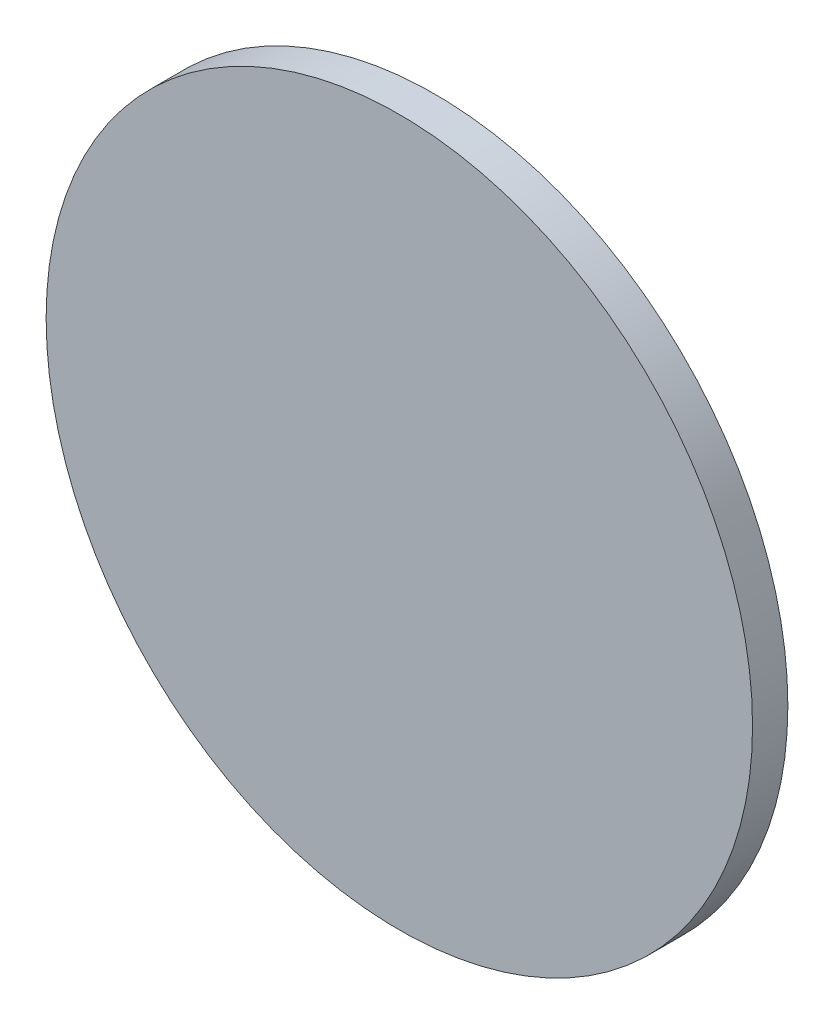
ISO-10303-21;
HEADER;
FILE_DESCRIPTION(('STEP AP214'),'2;1');
FILE_NAME('part.step','',(''),(''),'','','');
FILE_SCHEMA(('AUTOMOTIVE_DESIGN { 1 0 10303 214 1 1 1 1 }'));
ENDSEC;
DATA;
#1=APPLICATION_CONTEXT('core data for automotive mechanical design processes');
#2=APPLICATION_PROTOCOL_DEFINITION('international standard','automotive_design',2000,#1);
#3=PRODUCT_CONTEXT('',#1,'mechanical');
#4=PRODUCT('Part','Part','',(#3));
#5=PRODUCT_RELATED_PRODUCT_CATEGORY('part','',(#4));
#6=PRODUCT_DEFINITION_FORMATION('','',#4);
#7=PRODUCT_DEFINITION_CONTEXT('part definition',#1,'design');
#8=PRODUCT_DEFINITION('design','',#6,#7);
#9=PRODUCT_DEFINITION_SHAPE('','',#8);
#10=(LENGTH_UNIT() NAMED_UNIT(*) SI_UNIT(.MILLI.,.METRE.));
#11=(NAMED_UNIT(*) PLANE_ANGLE_UNIT() SI_UNIT($,.RADIAN.));
#12=(NAMED_UNIT(*) SI_UNIT($,.STERADIAN.) SOLID_ANGLE_UNIT());
#13=UNCERTAINTY_MEASURE_WITH_UNIT(LENGTH_MEASURE(1.E-05),#10,'distance_accuracy_value','');
#14=(GEOMETRIC_REPRESENTATION_CONTEXT(3) GLOBAL_UNCERTAINTY_ASSIGNED_CONTEXT((#13)) GLOBAL_UNIT_ASSIGNED_CONTEXT((#10,
#11,#12)) REPRESENTATION_CONTEXT('',''));
#15=CARTESIAN_POINT('',(0.,0.,0.));
#16=DIRECTION('',(0.,0.,1.));
#17=DIRECTION('',(1.,0.,0.));
#18=AXIS2_PLACEMENT_3D('',#15,#16,#17);
#19=CARTESIAN_POINT('',(0.,0.,14.6421356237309));
#20=DIRECTION('',(0.,0.,-1.));
#21=DIRECTION('',(-1.,0.,0.));
#22=AXIS2_PLACEMENT_3D('',#19,#20,#21);
#23=CYLINDRICAL_SURFACE('',#22,5.);
#24=CARTESIAN_POINT('',(0.,0.,0.));
#25=DIRECTION('',(0.,0.,1.));
#26=DIRECTION('',(1.,0.,0.));
#27=AXIS2_PLACEMENT_3D('',#24,#25,#26);
#28=CIRCLE('',#27,5.);
#29=CARTESIAN_POINT('',(-5.,0.,0.));
#30=VERTEX_POINT('',#29);
#31=EDGE_CURVE('E37',#30,#30,#28,.T.);
#32=CARTESIAN_POINT('',(0.,0.,0.499999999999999));
#33=DIRECTION('',(0.,0.,1.));
#34=DIRECTION('',(1.,0.,0.));
#35=AXIS2_PLACEMENT_3D('',#32,#33,#34);
#36=CIRCLE('',#35,5.);
#37=CARTESIAN_POINT('',(-5.,0.,0.499999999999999));
#38=VERTEX_POINT('',#37);
#39=EDGE_CURVE('E10',#38,#38,#36,.T.);
#40=CARTESIAN_POINT('',(-5.,0.,0.));
#41=CARTESIAN_POINT('',(-5.,0.,0.0052083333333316));
#42=CARTESIAN_POINT('',(-5.,0.,0.0104166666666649));
#43=CARTESIAN_POINT('',(-5.,0.,0.0208333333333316));
#44=CARTESIAN_POINT('',(-5.,0.,0.026041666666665));
#45=CARTESIAN_POINT('',(-5.,0.,0.0364583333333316));
#46=CARTESIAN_POINT('',(-5.,0.,0.041666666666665));
#47=CARTESIAN_POINT('',(-5.,0.,0.0520833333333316));
#48=CARTESIAN_POINT('',(-5.,0.,0.057291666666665));
#49=CARTESIAN_POINT('',(-5.,0.,0.0677083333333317));
#50=CARTESIAN_POINT('',(-5.,0.,0.072916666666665));
#51=CARTESIAN_POINT('',(-5.,0.,0.0833333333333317));
#52=CARTESIAN_POINT('',(-5.,0.,0.088541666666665));
#53=CARTESIAN_POINT('',(-5.,0.,0.0989583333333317));
#54=CARTESIAN_POINT('',(-5.,0.,0.104166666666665));
#55=CARTESIAN_POINT('',(-5.,0.,0.114583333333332));
#56=CARTESIAN_POINT('',(-5.,0.,0.119791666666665));
#57=CARTESIAN_POINT('',(-5.,0.,0.130208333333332));
#58=CARTESIAN_POINT('',(-5.,0.,0.135416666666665));
#59=CARTESIAN_POINT('',(-5.,0.,0.145833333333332));
#60=CARTESIAN_POINT('',(-5.,0.,0.151041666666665));
#61=CARTESIAN_POINT('',(-5.,0.,0.161458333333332));
#62=CARTESIAN_POINT('',(-5.,0.,0.166666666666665));
#63=CARTESIAN_POINT('',(-5.,0.,0.177083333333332));
#64=CARTESIAN_POINT('',(-5.,0.,0.182291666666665));
#65=CARTESIAN_POINT('',(-5.,0.,0.192708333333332));
#66=CARTESIAN_POINT('',(-5.,0.,0.197916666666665));
#67=CARTESIAN_POINT('',(-5.,0.,0.208333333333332));
#68=CARTESIAN_POINT('',(-5.,0.,0.213541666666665));
#69=CARTESIAN_POINT('',(-5.,0.,0.223958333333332));
#70=CARTESIAN_POINT('',(-5.,0.,0.229166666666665));
#71=CARTESIAN_POINT('',(-5.,0.,0.239583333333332));
#72=CARTESIAN_POINT('',(-5.,0.,0.244791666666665));
#73=CARTESIAN_POINT('',(-5.,0.,0.255208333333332));
#74=CARTESIAN_POINT('',(-5.,0.,0.260416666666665));
#75=CARTESIAN_POINT('',(-5.,0.,0.270833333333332));
#76=CARTESIAN_POINT('',(-5.,0.,0.276041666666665));
#77=CARTESIAN_POINT('',(-5.,0.,0.286458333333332));
#78=CARTESIAN_POINT('',(-5.,0.,0.291666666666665));
#79=CARTESIAN_POINT('',(-5.,0.,0.302083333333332));
#80=CARTESIAN_POINT('',(-5.,0.,0.307291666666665));
#81=CARTESIAN_POINT('',(-5.,0.,0.317708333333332));
#82=CARTESIAN_POINT('',(-5.,0.,0.322916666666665));
#83=CARTESIAN_POINT('',(-5.,0.,0.333333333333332));
#84=CARTESIAN_POINT('',(-5.,0.,0.338541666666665));
#85=CARTESIAN_POINT('',(-5.,0.,0.348958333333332));
#86=CARTESIAN_POINT('',(-5.,0.,0.354166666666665));
#87=CARTESIAN_POINT('',(-5.,0.,0.364583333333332));
#88=CARTESIAN_POINT('',(-5.,0.,0.369791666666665));
#89=CARTESIAN_POINT('',(-5.,0.,0.380208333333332));
#90=CARTESIAN_POINT('',(-5.,0.,0.385416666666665));
#91=CARTESIAN_POINT('',(-5.,0.,0.395833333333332));
#92=CARTESIAN_POINT('',(-5.,0.,0.401041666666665));
#93=CARTESIAN_POINT('',(-5.,0.,0.411458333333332));
#94=CARTESIAN_POINT('',(-5.,0.,0.416666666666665));
#95=CARTESIAN_POINT('',(-5.,0.,0.427083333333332));
#96=CARTESIAN_POINT('',(-5.,0.,0.432291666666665));
#97=CARTESIAN_POINT('',(-5.,0.,0.442708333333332));
#98=CARTESIAN_POINT('',(-5.,0.,0.447916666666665));
#99=CARTESIAN_POINT('',(-5.,0.,0.458333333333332));
#100=CARTESIAN_POINT('',(-5.,0.,0.463541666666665));
#101=CARTESIAN_POINT('',(-5.,0.,0.473958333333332));
#102=CARTESIAN_POINT('',(-5.,0.,0.479166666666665));
#103=CARTESIAN_POINT('',(-5.,0.,0.489583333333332));
#104=CARTESIAN_POINT('',(-5.,0.,0.494791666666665));
#105=CARTESIAN_POINT('',(-5.,0.,0.499999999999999));
#106=B_SPLINE_CURVE_WITH_KNOTS('',3,(#40,#41,#42,#43,#44,#45,#46,#47,#48,#49,#50,#51,#52,#53,
#54,#55,#56,#57,#58,#59,#60,#61,#62,#63,#64,#65,#66,#67,#68,#69,#70,#71,#72,#73,#74,#75,#76,#77,
#78,#79,#80,#81,#82,#83,#84,#85,#86,#87,#88,#89,#90,#91,#92,#93,#94,#95,#96,#97,#98,#99,#100,
#101,#102,#103,#104,#105),.UNSPECIFIED.,.F.,.F.,(4,2,2,2,2,2,2,2,2,2,2,2,2,2,2,2,2,2,2,2,2,2,2,
2,2,2,2,2,2,2,2,2,4),(0.,0.015625,0.03125,0.046875,0.0625000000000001,0.0781250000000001,
0.0937500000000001,0.109375,0.125,0.140625,0.15625,0.171875,0.1875,0.203125,0.21875,0.234375,
0.25,0.265625,0.28125,0.296875,0.3125,0.328125,0.34375,0.359375,0.375,0.390625,0.40625,0.421875,
0.4375,0.453125,0.46875,0.484375,0.5),.UNSPECIFIED.);
#107=EDGE_CURVE('BSEAM30',#30,#38,#106,.T.);
#108=ORIENTED_EDGE('',*,*,#31,.T.);
#109=ORIENTED_EDGE('',*,*,#39,.F.);
#110=ORIENTED_EDGE('',*,*,#107,.T.);
#111=ORIENTED_EDGE('',*,*,#107,.F.);
#112=EDGE_LOOP('',(#108,#110,#109,#111));
#113=FACE_BOUND('',#112,.T.);
#114=ADVANCED_FACE('F30',(#113),#23,.T.);
#115=CARTESIAN_POINT('',(0.,0.,0.));
#116=DIRECTION('',(0.,0.,1.));
#117=DIRECTION('',(1.,0.,0.));
#118=AXIS2_PLACEMENT_3D('',#115,#116,#117);
#119=PLANE('',#118);
#120=ORIENTED_EDGE('',*,*,#31,.F.);
#121=EDGE_LOOP('',(#120));
#122=FACE_BOUND('',#121,.T.);
#123=ADVANCED_FACE('F45',(#122),#119,.F.);
#124=CARTESIAN_POINT('',(0.,0.,0.499999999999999));
#125=DIRECTION('',(0.,0.,1.));
#126=DIRECTION('',(0.,-1.,0.));
#127=AXIS2_PLACEMENT_3D('',#124,#125,#126);
#128=PLANE('',#127);
#129=ORIENTED_EDGE('',*,*,#39,.T.);
#130=EDGE_LOOP('',(#129));
#131=FACE_BOUND('',#130,.T.);
#132=ADVANCED_FACE('F32',(#131),#128,.T.);
#133=CLOSED_SHELL('',(#114,#123,#132));
#134=MANIFOLD_SOLID_BREP('B2',#133);
#135=ADVANCED_BREP_SHAPE_REPRESENTATION('',(#18,#134),#14);
#136=SHAPE_DEFINITION_REPRESENTATION(#9,#135);
ENDSEC;
END-ISO-10303-21;
